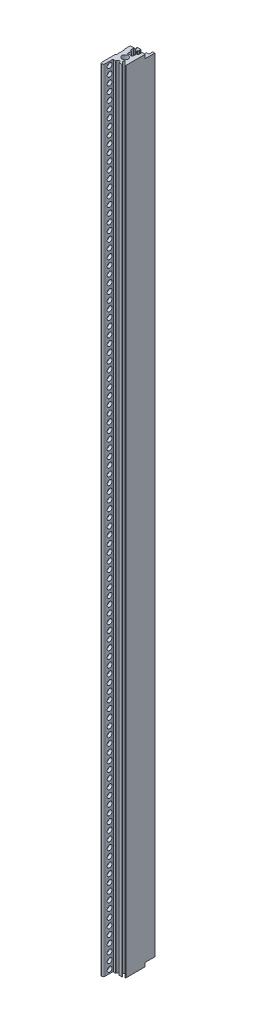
from build123d import *

# Parameters (mm, degrees)
SKETCH_1_R          = 1.6
EXTRUDE_1_DEPTH     = 266.7
SKETCH_7_W          = 5.4
SKETCH_7_H          = 2.5
SKETCH_7_H_2        = 1.2
CUT_EXTRUDE_6_DEPTH = 534.63429425
FILLET_1_R          = 0.2
SKETCH_2_R          = 2.1
CUT_EXTRUDE_1_DEPTH = 10
CUT_EXTRUDE_START   = -10
SKETCH_3_R          = 2.1
CUT_EXTRUDE_2_DEPTH = 10
SKETCH_4_R          = 1.65
CUT_EXTRUDE_3_DEPTH = 12
SKETCH_5_W          = 6.5
SKETCH_5_H          = 2.54
CUT_EXTRUDE_4_DEPTH = 10


with BuildPart() as part:
    # Sketch 1 → Extrude 1 (new, symmetric)
    with BuildSketch(Plane(origin=(0, 0, 0), x_dir=(1, 0, 0), z_dir=(0, 1, 0))):
        with BuildLine():
            Line((-4.20000049, 11.89999994), (-3.89999944, 11.899999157))
            ThreePointArc((-3.89999944, 11.899999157), (-3.758578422, 11.841420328), (-3.699999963, 11.699999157))
            Line((-3.699999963, 11.699999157), (-3.699999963, 9.94999994))
            ThreePointArc((-3.699999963, 9.94999994), (-3.758578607, 9.808578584), (-3.899999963, 9.74999994))
            Line((-3.899999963, 9.74999994), (-4.25, 9.74999994))
            ThreePointArc((-4.25, 9.74999994), (-4.391421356, 9.691421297), (-4.45, 9.54999994))
            Line((-4.45, 9.54999994), (-4.45, 8.5))
            Line((-4.45, 8.5), (-4.7, 8.5))
            Line((-4.7, 8.5), (-5, 8.2))
            Line((-5, 8.2), (-5, 7.4))
            Line((-5, 7.4), (-5, 4.4))
            Line((-5, 4.4), (-4.549867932, 3.899804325))
            Line((-4.549867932, 3.899804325), (-4.550132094, -1.100195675))
            Line((-4.550132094, -1.100195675), (-5, -1.6))
            Line((-5, -1.6), (-5, -10.75))
            ThreePointArc((-5, -10.75), (-4, -11.75), (-3, -10.75))
            Line((-3, -10.75), (-3, -5.75))
            ThreePointArc((-3, -5.75), (-2.853553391, -5.396446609), (-2.5, -5.25))
            Line((-2.5, -5.25), (-1.15000013, -5.25))
            ThreePointArc((-1.15000013, -5.25), (-1.079289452, -5.220710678), (-1.05000013, -5.15))
            Line((-1.05000013, -5.15), (-1.05000013, -5))
            ThreePointArc((-1.05000013, -5), (-1.3e-07, -3.95), (1.04999987, -5))
            Line((1.04999987, -5), (1.04999987, -5.15))
            ThreePointArc((1.04999987, -5.15), (1.079289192, -5.220710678), (1.14999987, -5.25))
            Line((1.14999987, -5.25), (3.070348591, -5.25))
            ThreePointArc((3.070348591, -5.25), (3.255124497, -5.126536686), (3.211769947, -4.908578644))
            Line((3.211769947, -4.908578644), (1.688730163, -3.385538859))
            ThreePointArc((1.688730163, -3.385538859), (1.688730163, -2.537010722), (2.5372583, -2.537010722))
            Line((2.5372583, -2.537010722), (4.658578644, -4.658331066))
            ThreePointArc((4.658578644, -4.658331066), (4.876536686, -4.701685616), (5, -4.516909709))
            Line((5, -4.516909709), (5, -2.080961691))
            Line((5, -2.080961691), (5, 5.179349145))
            Line((5, 5.179349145), (5, 15))
            Line((5, 15), (3.59999987, 15))
            Line((3.59999987, 15), (3.59999987, 12.5))
            Line((3.59999987, 12.5), (1.94999987, 12.5))
            Line((1.94999987, 12.5), (1.94999987, 10.55))
            Line((1.94999987, 10.55), (2.84999987, 10.55))
            Line((2.84999987, 10.55), (2.84999987, 9.35))
            Line((2.84999987, 9.35), (1.94999987, 9.35))
            Line((1.94999987, 9.35), (1.94999987, 8.35))
            Line((1.94999987, 8.35), (2.84999987, 8.35))
            Line((2.84999987, 8.35), (2.84999987, 6.05))
            Line((2.84999987, 6.05), (1.94999987, 6.05))
            Line((1.94999987, 6.05), (1.94999987, 3.885550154))
            ThreePointArc((1.94999987, 3.885550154), (1.567454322, 3.098943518), (0.71249987, 2.914162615))
            ThreePointArc((0.71249987, 2.914162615), (-0.242015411, 2.990222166), (-1.17187513, 2.761649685))
            ThreePointArc((-1.17187513, 2.761649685), (-1.360397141, 2.778988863), (-1.45000013, 2.945759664))
            Line((-1.45000013, 2.945759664), (-1.45000013, 6.05))
            Line((-1.45000013, 6.05), (-2.35000013, 6.05))
            Line((-2.35000013, 6.05), (-2.35000013, 8.35))
            Line((-2.35000013, 8.35), (-1.45000013, 8.35))
            Line((-1.45000013, 8.35), (-1.45000013, 9.35))
            Line((-1.45000013, 9.35), (-2.35000013, 9.35))
            Line((-2.35000013, 9.35), (-2.35000013, 10.55))
            Line((-2.35000013, 10.55), (-1.300000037, 10.55))
            Line((-1.300000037, 10.55), (-1.300000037, 10.617157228))
            ThreePointArc((-1.300000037, 10.617157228), (-1.315224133, 10.693693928), (-1.358578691, 10.758578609))
            Line((-1.358578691, 10.758578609), (-1.941421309, 11.341421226))
            ThreePointArc((-1.941421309, 11.341421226), (-1.984775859, 11.406305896), (-1.999999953, 11.482842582))
            Line((-1.999999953, 11.482842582), (-1.999999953, 11.699999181))
            ThreePointArc((-1.999999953, 11.699999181), (-1.941421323, 11.841420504), (-1.8, 11.899999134))
            Line((-1.8, 11.899999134), (-1.7, 11.899999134))
            ThreePointArc((-1.7, 11.899999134), (-1.558578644, 11.958577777), (-1.5, 12.099999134))
            Line((-1.5, 12.099999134), (-1.5, 12.199999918))
            ThreePointArc((-1.5, 12.199999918), (-1.558578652, 12.341421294), (-1.700000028, 12.399999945))
            Line((-1.700000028, 12.399999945), (-1.867157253, 12.399999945))
            ThreePointArc((-1.867157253, 12.399999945), (-1.943693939, 12.415224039), (-2.008578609, 12.458578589))
            Line((-2.008578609, 12.458578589), (-2.050000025, 12.500000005))
            Line((-2.050000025, 12.500000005), (-3.849999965, 12.500000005))
            Line((-3.849999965, 12.500000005), (-3.891421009, 12.458578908))
            ThreePointArc((-3.891421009, 12.458578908), (-3.95630571, 12.415224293), (-4.032842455, 12.400000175))
            Line((-4.032842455, 12.400000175), (-4.199999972, 12.400000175))
            ThreePointArc((-4.199999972, 12.400000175), (-4.341421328, 12.341421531), (-4.399999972, 12.200000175))
            Line((-4.399999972, 12.200000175), (-4.399999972, 12.099999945))
            ThreePointArc((-4.399999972, 12.099999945), (-4.341421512, 11.95857877), (-4.20000049, 11.89999994))
        make_face()
        with Locations(Location((-1.3e-07, 0, 0), (0, 0, 270))):
            Circle(SKETCH_1_R, mode=Mode.SUBTRACT)
    extrude(amount=EXTRUDE_1_DEPTH, both=True)

    # Sketch 7 → Cut-Extrude 6 (cut, through all)
    with BuildSketch(Plane(origin=(0, 266.7, 0), x_dir=(1, 0, 0), z_dir=(0, 1, 0))):
        with Locations((0.24999987, 7.1)):
            Rectangle(SKETCH_7_W, SKETCH_7_H)
        with Locations((0.24999987, 9.95)):
            Rectangle(SKETCH_7_W, SKETCH_7_H_2)
    extrude(amount=-CUT_EXTRUDE_6_DEPTH, mode=Mode.SUBTRACT)

    # Fillet 1
    fillet_1_edges = [part.edges().sort_by_distance(p)[0] for p in [
        (2.94999987, 0, -5.85),
        (-2.45000013, 0, -8.35),
        (2.94999987, 0, -8.35),
        (-2.45000013, 0, -5.85),
        (2.94999987, 0, -9.35),
        (-2.45000013, 0, -10.55),
        (2.94999987, 0, -10.55),
        (-2.45000013, 0, -9.35),
    ]]
    fillet(fillet_1_edges, radius=FILLET_1_R)

    # Sketch 2 → Cut-Extrude 1 (cut)
    with BuildSketch(Plane(origin=(0, 266.7, 0), x_dir=(1, 0, 0), z_dir=(0, 1, 0))):
        with Locations(Location((0, 0, 0), (0, 0, 270))):
            Circle(SKETCH_2_R)
    extrude(amount=-CUT_EXTRUDE_1_DEPTH, mode=Mode.SUBTRACT)

    # Sketch 3 → Cut-Extrude 2 (cut)
    with BuildSketch(Plane.XZ.offset(266.7).offset(CUT_EXTRUDE_START)):
        with Locations(Location((0, 0, 0), (0, 0, 90))):
            Circle(SKETCH_3_R)
    extrude(amount=CUT_EXTRUDE_2_DEPTH, mode=Mode.SUBTRACT)

    # Sketch 4 → Cut-Extrude 3 (cut)
    with BuildSketch(Plane.ZY.offset(5)):
        with Locations((7.5, -264.16)):
            Circle(SKETCH_4_R)
        with Locations((7.5, -259.08)):
            Circle(SKETCH_4_R)
        with Locations((7.5, -254)):
            Circle(SKETCH_4_R)
        with Locations((7.5, -248.92)):
            Circle(SKETCH_4_R)
        with Locations((7.5, -243.84)):
            Circle(SKETCH_4_R)
        with Locations((7.5, -238.76)):
            Circle(SKETCH_4_R)
        with Locations((7.5, -233.68)):
            Circle(SKETCH_4_R)
        with Locations((7.5, -228.6)):
            Circle(SKETCH_4_R)
        with Locations((7.5, -223.52)):
            Circle(SKETCH_4_R)
        with Locations((7.5, -218.44)):
            Circle(SKETCH_4_R)
        with Locations((7.5, -213.36)):
            Circle(SKETCH_4_R)
        with Locations((7.5, -208.28)):
            Circle(SKETCH_4_R)
        with Locations((7.5, -203.2)):
            Circle(SKETCH_4_R)
        with Locations((7.5, -198.12)):
            Circle(SKETCH_4_R)
        with Locations((7.5, -193.04)):
            Circle(SKETCH_4_R)
        with Locations((7.5, -187.96)):
            Circle(SKETCH_4_R)
        with Locations((7.5, -182.88)):
            Circle(SKETCH_4_R)
        with Locations((7.5, -177.8)):
            Circle(SKETCH_4_R)
        with Locations((7.5, -172.72)):
            Circle(SKETCH_4_R)
        with Locations((7.5, -167.64)):
            Circle(SKETCH_4_R)
        with Locations((7.5, -162.56)):
            Circle(SKETCH_4_R)
        with Locations((7.5, -157.48)):
            Circle(SKETCH_4_R)
        with Locations((7.5, -152.4)):
            Circle(SKETCH_4_R)
        with Locations((7.5, -147.32)):
            Circle(SKETCH_4_R)
        with Locations((7.5, -142.24)):
            Circle(SKETCH_4_R)
        with Locations((7.5, -137.16)):
            Circle(SKETCH_4_R)
        with Locations((7.5, -132.08)):
            Circle(SKETCH_4_R)
        with Locations((7.5, -127)):
            Circle(SKETCH_4_R)
        with Locations((7.5, -121.92)):
            Circle(SKETCH_4_R)
        with Locations((7.5, -116.84)):
            Circle(SKETCH_4_R)
        with Locations((7.5, -111.76)):
            Circle(SKETCH_4_R)
        with Locations((7.5, -106.68)):
            Circle(SKETCH_4_R)
        with Locations((7.5, -101.6)):
            Circle(SKETCH_4_R)
        with Locations((7.5, -96.52)):
            Circle(SKETCH_4_R)
        with Locations((7.5, -91.44)):
            Circle(SKETCH_4_R)
        with Locations((7.5, -86.36)):
            Circle(SKETCH_4_R)
        with Locations((7.5, -81.28)):
            Circle(SKETCH_4_R)
        with Locations((7.5, -76.2)):
            Circle(SKETCH_4_R)
        with Locations((7.5, -71.12)):
            Circle(SKETCH_4_R)
        with Locations((7.5, -66.04)):
            Circle(SKETCH_4_R)
        with Locations((7.5, -60.96)):
            Circle(SKETCH_4_R)
        with Locations((7.5, -55.88)):
            Circle(SKETCH_4_R)
        with Locations((7.5, -50.8)):
            Circle(SKETCH_4_R)
        with Locations((7.5, -45.72)):
            Circle(SKETCH_4_R)
        with Locations((7.5, -40.64)):
            Circle(SKETCH_4_R)
        with Locations((7.5, -35.56)):
            Circle(SKETCH_4_R)
        with Locations((7.5, -30.48)):
            Circle(SKETCH_4_R)
        with Locations((7.5, -25.4)):
            Circle(SKETCH_4_R)
        with Locations((7.5, -20.32)):
            Circle(SKETCH_4_R)
        with Locations((7.5, -15.24)):
            Circle(SKETCH_4_R)
        with Locations((7.5, -10.16)):
            Circle(SKETCH_4_R)
        with Locations((7.5, -5.08)):
            Circle(SKETCH_4_R)
        with Locations((7.5, 0)):
            Circle(SKETCH_4_R)
        with Locations((7.5, 5.08)):
            Circle(SKETCH_4_R)
        with Locations((7.5, 10.16)):
            Circle(SKETCH_4_R)
        with Locations((7.5, 15.24)):
            Circle(SKETCH_4_R)
        with Locations((7.5, 20.32)):
            Circle(SKETCH_4_R)
        with Locations((7.5, 25.4)):
            Circle(SKETCH_4_R)
        with Locations((7.5, 30.48)):
            Circle(SKETCH_4_R)
        with Locations((7.5, 35.56)):
            Circle(SKETCH_4_R)
        with Locations((7.5, 40.64)):
            Circle(SKETCH_4_R)
        with Locations((7.5, 45.72)):
            Circle(SKETCH_4_R)
        with Locations((7.5, 50.8)):
            Circle(SKETCH_4_R)
        with Locations((7.5, 55.88)):
            Circle(SKETCH_4_R)
        with Locations((7.5, 60.96)):
            Circle(SKETCH_4_R)
        with Locations((7.5, 66.04)):
            Circle(SKETCH_4_R)
        with Locations((7.5, 71.12)):
            Circle(SKETCH_4_R)
        with Locations((7.5, 76.2)):
            Circle(SKETCH_4_R)
        with Locations((7.5, 81.28)):
            Circle(SKETCH_4_R)
        with Locations((7.5, 86.36)):
            Circle(SKETCH_4_R)
        with Locations((7.5, 91.44)):
            Circle(SKETCH_4_R)
        with Locations((7.5, 96.52)):
            Circle(SKETCH_4_R)
        with Locations((7.5, 101.6)):
            Circle(SKETCH_4_R)
        with Locations((7.5, 106.68)):
            Circle(SKETCH_4_R)
        with Locations((7.5, 111.76)):
            Circle(SKETCH_4_R)
        with Locations((7.5, 116.84)):
            Circle(SKETCH_4_R)
        with Locations((7.5, 121.92)):
            Circle(SKETCH_4_R)
        with Locations((7.5, 127)):
            Circle(SKETCH_4_R)
        with Locations((7.5, 132.08)):
            Circle(SKETCH_4_R)
        with Locations((7.5, 137.16)):
            Circle(SKETCH_4_R)
        with Locations((7.5, 142.24)):
            Circle(SKETCH_4_R)
        with Locations((7.5, 147.32)):
            Circle(SKETCH_4_R)
        with Locations((7.5, 152.4)):
            Circle(SKETCH_4_R)
        with Locations((7.5, 157.48)):
            Circle(SKETCH_4_R)
        with Locations((7.5, 162.56)):
            Circle(SKETCH_4_R)
        with Locations((7.5, 223.52)):
            Circle(SKETCH_4_R)
        with Locations((7.5, 248.92)):
            Circle(SKETCH_4_R)
        with Locations((7.5, 182.88)):
            Circle(SKETCH_4_R)
        with Locations((7.5, 218.44)):
            Circle(SKETCH_4_R)
        with Locations((7.5, 167.64)):
            Circle(SKETCH_4_R)
        with Locations((7.5, 198.12)):
            Circle(SKETCH_4_R)
        with Locations((7.5, 254)):
            Circle(SKETCH_4_R)
        with Locations((7.5, 193.04)):
            Circle(SKETCH_4_R)
        with Locations((7.5, 208.28)):
            Circle(SKETCH_4_R)
        with Locations((7.5, 243.84)):
            Circle(SKETCH_4_R)
        with Locations((7.5, 187.96)):
            Circle(SKETCH_4_R)
        with Locations((7.5, 203.2)):
            Circle(SKETCH_4_R)
        with Locations((7.5, 259.08)):
            Circle(SKETCH_4_R)
        with Locations((7.5, 213.36)):
            Circle(SKETCH_4_R)
        with Locations((7.5, 177.8)):
            Circle(SKETCH_4_R)
        with Locations((7.5, 228.6)):
            Circle(SKETCH_4_R)
        with Locations((7.5, 233.68)):
            Circle(SKETCH_4_R)
        with Locations((7.5, 238.76)):
            Circle(SKETCH_4_R)
        with Locations((7.5, 172.72)):
            Circle(SKETCH_4_R)
        with Locations((7.5, 264.16)):
            Circle(SKETCH_4_R)
    extrude(amount=-CUT_EXTRUDE_3_DEPTH, mode=Mode.SUBTRACT)

    # Sketch 5 → Cut-Extrude 4 (cut)
    with BuildSketch(Plane(origin=(5, 0, 0), x_dir=(0, 0, -1), z_dir=(1, 0, 0))):
        with Locations((11.75, 265.43)):
            Rectangle(SKETCH_5_W, SKETCH_5_H)
        with Locations((11.75, -265.43)):
            Rectangle(SKETCH_5_W, SKETCH_5_H)
    extrude(amount=-CUT_EXTRUDE_4_DEPTH, mode=Mode.SUBTRACT)


solid = part.part
